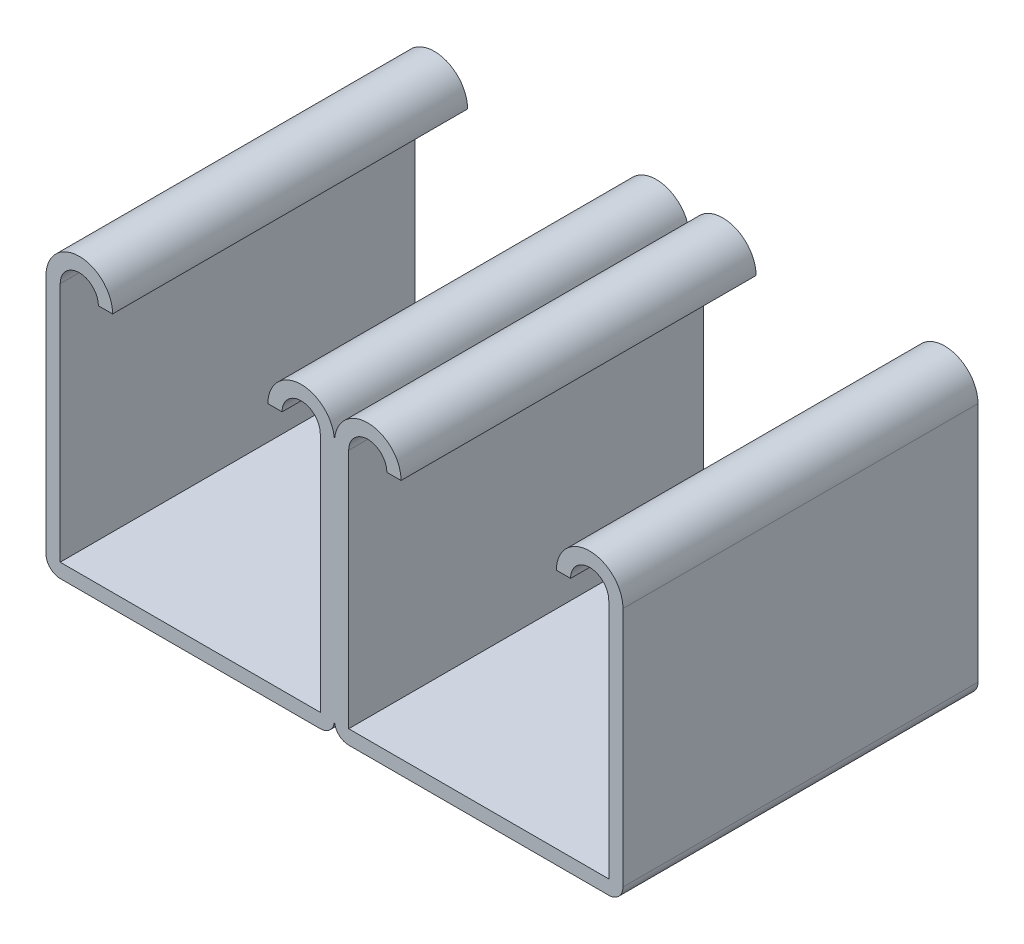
ISO-10303-21;
HEADER;
FILE_DESCRIPTION(('STEP AP214'),'2;1');
FILE_NAME('part.step','',(''),(''),'','','');
FILE_SCHEMA(('AUTOMOTIVE_DESIGN { 1 0 10303 214 1 1 1 1 }'));
ENDSEC;
DATA;
#1=APPLICATION_CONTEXT('core data for automotive mechanical design processes');
#2=APPLICATION_PROTOCOL_DEFINITION('international standard','automotive_design',2000,#1);
#3=PRODUCT_CONTEXT('',#1,'mechanical');
#4=PRODUCT('Part','Part','',(#3));
#5=PRODUCT_RELATED_PRODUCT_CATEGORY('part','',(#4));
#6=PRODUCT_DEFINITION_FORMATION('','',#4);
#7=PRODUCT_DEFINITION_CONTEXT('part definition',#1,'design');
#8=PRODUCT_DEFINITION('design','',#6,#7);
#9=PRODUCT_DEFINITION_SHAPE('','',#8);
#10=(LENGTH_UNIT() NAMED_UNIT(*) SI_UNIT(.MILLI.,.METRE.));
#11=(NAMED_UNIT(*) PLANE_ANGLE_UNIT() SI_UNIT($,.RADIAN.));
#12=(NAMED_UNIT(*) SI_UNIT($,.STERADIAN.) SOLID_ANGLE_UNIT());
#13=UNCERTAINTY_MEASURE_WITH_UNIT(LENGTH_MEASURE(1.E-05),#10,'distance_accuracy_value','');
#14=(GEOMETRIC_REPRESENTATION_CONTEXT(3) GLOBAL_UNCERTAINTY_ASSIGNED_CONTEXT((#13)) GLOBAL_UNIT_ASSIGNED_CONTEXT((#10,
#11,#12)) REPRESENTATION_CONTEXT('',''));
#15=CARTESIAN_POINT('',(0.,0.,0.));
#16=DIRECTION('',(0.,0.,1.));
#17=DIRECTION('',(1.,0.,0.));
#18=AXIS2_PLACEMENT_3D('',#15,#16,#17);
#19=CARTESIAN_POINT('',(-18.25625,9.37895,12.7));
#20=DIRECTION('',(0.,0.,-1.));
#21=DIRECTION('',(-1.,0.,0.));
#22=AXIS2_PLACEMENT_3D('',#19,#20,#21);
#23=CYLINDRICAL_SURFACE('',#22,2.38125);
#24=CARTESIAN_POINT('',(-18.25625,9.37895,-12.7));
#25=DIRECTION('',(0.,0.,1.));
#26=DIRECTION('',(-1.,0.,0.));
#27=AXIS2_PLACEMENT_3D('',#24,#25,#26);
#28=CIRCLE('',#27,2.38125);
#29=CARTESIAN_POINT('',(-15.875,9.37895,-12.7));
#30=VERTEX_POINT('',#29);
#31=CARTESIAN_POINT('',(-20.6375,9.37895,-12.7));
#32=VERTEX_POINT('',#31);
#33=EDGE_CURVE('E166',#30,#32,#28,.T.);
#34=ORIENTED_EDGE('',*,*,#33,.T.);
#35=DIRECTION('',(0.,0.,-1.));
#36=VECTOR('',#35,1.);
#37=CARTESIAN_POINT('',(-20.6375,9.37895,12.7));
#38=LINE('',#37,#36);
#39=CARTESIAN_POINT('',(-20.6375,9.37895,12.7));
#40=VERTEX_POINT('',#39);
#41=EDGE_CURVE('E11',#40,#32,#38,.T.);
#42=ORIENTED_EDGE('',*,*,#41,.F.);
#43=CARTESIAN_POINT('',(-18.25625,9.37895,12.7));
#44=DIRECTION('',(0.,0.,1.));
#45=DIRECTION('',(-1.,0.,0.));
#46=AXIS2_PLACEMENT_3D('',#43,#44,#45);
#47=CIRCLE('',#46,2.38125);
#48=CARTESIAN_POINT('',(-15.875,9.37895,12.7));
#49=VERTEX_POINT('',#48);
#50=EDGE_CURVE('E191',#49,#40,#47,.T.);
#51=ORIENTED_EDGE('',*,*,#50,.F.);
#52=DIRECTION('',(0.,0.,-1.));
#53=VECTOR('',#52,1.);
#54=CARTESIAN_POINT('',(-15.875,9.37895,12.7));
#55=LINE('',#54,#53);
#56=EDGE_CURVE('E162',#49,#30,#55,.T.);
#57=ORIENTED_EDGE('',*,*,#56,.T.);
#58=EDGE_LOOP('',(#34,#42,#51,#57));
#59=FACE_BOUND('',#58,.T.);
#60=ADVANCED_FACE('F33',(#59),#23,.T.);
#61=CARTESIAN_POINT('',(-20.6375,9.37895,12.7));
#62=DIRECTION('',(1.,0.,0.));
#63=DIRECTION('',(0.,1.,0.));
#64=AXIS2_PLACEMENT_3D('',#61,#62,#63);
#65=PLANE('',#64);
#66=DIRECTION('',(0.,-1.,0.));
#67=VECTOR('',#66,1.);
#68=CARTESIAN_POINT('',(-20.6375,9.37895,-12.7));
#69=LINE('',#68,#67);
#70=CARTESIAN_POINT('',(-20.6375,-7.874,-12.7));
#71=VERTEX_POINT('',#70);
#72=EDGE_CURVE('E169',#32,#71,#69,.T.);
#73=ORIENTED_EDGE('',*,*,#72,.T.);
#74=DIRECTION('',(0.,0.,-1.));
#75=VECTOR('',#74,1.);
#76=CARTESIAN_POINT('',(-20.6375,-7.874,12.7));
#77=LINE('',#76,#75);
#78=CARTESIAN_POINT('',(-20.6375,-7.874,12.7));
#79=VERTEX_POINT('',#78);
#80=EDGE_CURVE('E41',#79,#71,#77,.T.);
#81=ORIENTED_EDGE('',*,*,#80,.F.);
#82=DIRECTION('',(0.,-1.,0.));
#83=VECTOR('',#82,1.);
#84=CARTESIAN_POINT('',(-20.6375,9.37895,12.7));
#85=LINE('',#84,#83);
#86=EDGE_CURVE('E108',#40,#79,#85,.T.);
#87=ORIENTED_EDGE('',*,*,#86,.F.);
#88=ORIENTED_EDGE('',*,*,#41,.T.);
#89=EDGE_LOOP('',(#73,#81,#87,#88));
#90=FACE_BOUND('',#89,.T.);
#91=ADVANCED_FACE('F278',(#90),#65,.F.);
#92=CARTESIAN_POINT('',(-19.6215,-7.874,12.7));
#93=DIRECTION('',(0.,0.,-1.));
#94=DIRECTION('',(-1.,0.,0.));
#95=AXIS2_PLACEMENT_3D('',#92,#93,#94);
#96=CYLINDRICAL_SURFACE('',#95,1.016);
#97=CARTESIAN_POINT('',(-19.6215,-7.874,-12.7));
#98=DIRECTION('',(0.,0.,1.));
#99=DIRECTION('',(-1.,0.,0.));
#100=AXIS2_PLACEMENT_3D('',#97,#98,#99);
#101=CIRCLE('',#100,1.016);
#102=CARTESIAN_POINT('',(-19.6215,-8.89,-12.7));
#103=VERTEX_POINT('',#102);
#104=EDGE_CURVE('E172',#71,#103,#101,.T.);
#105=ORIENTED_EDGE('',*,*,#104,.T.);
#106=DIRECTION('',(0.,0.,-1.));
#107=VECTOR('',#106,1.);
#108=CARTESIAN_POINT('',(-19.6215,-8.89,12.7));
#109=LINE('',#108,#107);
#110=CARTESIAN_POINT('',(-19.6215,-8.89,12.7));
#111=VERTEX_POINT('',#110);
#112=EDGE_CURVE('E216',#111,#103,#109,.T.);
#113=ORIENTED_EDGE('',*,*,#112,.F.);
#114=CARTESIAN_POINT('',(-19.6215,-7.874,12.7));
#115=DIRECTION('',(0.,0.,1.));
#116=DIRECTION('',(-1.,0.,0.));
#117=AXIS2_PLACEMENT_3D('',#114,#115,#116);
#118=CIRCLE('',#117,1.016);
#119=EDGE_CURVE('E224',#79,#111,#118,.T.);
#120=ORIENTED_EDGE('',*,*,#119,.F.);
#121=ORIENTED_EDGE('',*,*,#80,.T.);
#122=EDGE_LOOP('',(#105,#113,#120,#121));
#123=FACE_BOUND('',#122,.T.);
#124=ADVANCED_FACE('F222',(#123),#96,.T.);
#125=CARTESIAN_POINT('',(-19.6215,-8.89,12.7));
#126=DIRECTION('',(0.,1.,0.));
#127=DIRECTION('',(-1.,0.,0.));
#128=AXIS2_PLACEMENT_3D('',#125,#126,#127);
#129=PLANE('',#128);
#130=DIRECTION('',(1.,0.,0.));
#131=VECTOR('',#130,1.);
#132=CARTESIAN_POINT('',(-19.6215,-8.89,-12.7));
#133=LINE('',#132,#131);
#134=CARTESIAN_POINT('',(-1.016,-8.89,-12.7));
#135=VERTEX_POINT('',#134);
#136=EDGE_CURVE('E174',#103,#135,#133,.T.);
#137=ORIENTED_EDGE('',*,*,#136,.T.);
#138=DIRECTION('',(0.,0.,-1.));
#139=VECTOR('',#138,1.);
#140=CARTESIAN_POINT('',(-1.016,-8.89,12.7));
#141=LINE('',#140,#139);
#142=CARTESIAN_POINT('',(-1.016,-8.89,12.7));
#143=VERTEX_POINT('',#142);
#144=EDGE_CURVE('E213',#143,#135,#141,.T.);
#145=ORIENTED_EDGE('',*,*,#144,.F.);
#146=DIRECTION('',(1.,0.,0.));
#147=VECTOR('',#146,1.);
#148=CARTESIAN_POINT('',(-19.6215,-8.89,12.7));
#149=LINE('',#148,#147);
#150=EDGE_CURVE('E243',#111,#143,#149,.T.);
#151=ORIENTED_EDGE('',*,*,#150,.F.);
#152=ORIENTED_EDGE('',*,*,#112,.T.);
#153=EDGE_LOOP('',(#137,#145,#151,#152));
#154=FACE_BOUND('',#153,.T.);
#155=ADVANCED_FACE('F233',(#154),#129,.F.);
#156=CARTESIAN_POINT('',(-1.016,-7.874,12.7));
#157=DIRECTION('',(0.,0.,-1.));
#158=DIRECTION('',(-1.,0.,0.));
#159=AXIS2_PLACEMENT_3D('',#156,#157,#158);
#160=CYLINDRICAL_SURFACE('',#159,1.016);
#161=CARTESIAN_POINT('',(-1.016,-7.874,-12.7));
#162=DIRECTION('',(0.,0.,1.));
#163=DIRECTION('',(1.,0.,0.));
#164=AXIS2_PLACEMENT_3D('',#161,#162,#163);
#165=CIRCLE('',#164,1.016);
#166=CARTESIAN_POINT('',(0.,-7.874,-12.7));
#167=VERTEX_POINT('',#166);
#168=EDGE_CURVE('E176',#135,#167,#165,.T.);
#169=ORIENTED_EDGE('',*,*,#168,.T.);
#170=DIRECTION('',(0.,0.,-1.));
#171=VECTOR('',#170,1.);
#172=CARTESIAN_POINT('',(0.,-7.874,12.7));
#173=LINE('',#172,#171);
#174=CARTESIAN_POINT('',(0.,-7.874,12.7));
#175=VERTEX_POINT('',#174);
#176=EDGE_CURVE('E210',#175,#167,#173,.T.);
#177=ORIENTED_EDGE('',*,*,#176,.F.);
#178=CARTESIAN_POINT('',(-1.016,-7.874,12.7));
#179=DIRECTION('',(0.,0.,1.));
#180=DIRECTION('',(1.,0.,0.));
#181=AXIS2_PLACEMENT_3D('',#178,#179,#180);
#182=CIRCLE('',#181,1.016);
#183=EDGE_CURVE('E239',#143,#175,#182,.T.);
#184=ORIENTED_EDGE('',*,*,#183,.F.);
#185=ORIENTED_EDGE('',*,*,#144,.T.);
#186=EDGE_LOOP('',(#169,#177,#184,#185));
#187=FACE_BOUND('',#186,.T.);
#188=ADVANCED_FACE('F237',(#187),#160,.T.);
#189=CARTESIAN_POINT('',(-2.38125,9.37895,12.7));
#190=DIRECTION('',(0.,0.,-1.));
#191=DIRECTION('',(-1.,0.,0.));
#192=AXIS2_PLACEMENT_3D('',#189,#190,#191);
#193=CYLINDRICAL_SURFACE('',#192,2.38125);
#194=CARTESIAN_POINT('',(-2.38125,9.37895,-12.7));
#195=DIRECTION('',(0.,0.,1.));
#196=DIRECTION('',(1.,0.,0.));
#197=AXIS2_PLACEMENT_3D('',#194,#195,#196);
#198=CIRCLE('',#197,2.38125);
#199=CARTESIAN_POINT('',(0.,9.37895,-12.7));
#200=VERTEX_POINT('',#199);
#201=CARTESIAN_POINT('',(-4.7625,9.37895,-12.7));
#202=VERTEX_POINT('',#201);
#203=EDGE_CURVE('E178',#200,#202,#198,.T.);
#204=ORIENTED_EDGE('',*,*,#203,.T.);
#205=DIRECTION('',(0.,0.,-1.));
#206=VECTOR('',#205,1.);
#207=CARTESIAN_POINT('',(-4.7625,9.37895,12.7));
#208=LINE('',#207,#206);
#209=CARTESIAN_POINT('',(-4.7625,9.37895,12.7));
#210=VERTEX_POINT('',#209);
#211=EDGE_CURVE('E204',#210,#202,#208,.T.);
#212=ORIENTED_EDGE('',*,*,#211,.F.);
#213=CARTESIAN_POINT('',(-2.38125,9.37895,12.7));
#214=DIRECTION('',(0.,0.,1.));
#215=DIRECTION('',(1.,0.,0.));
#216=AXIS2_PLACEMENT_3D('',#213,#214,#215);
#217=CIRCLE('',#216,2.38125);
#218=CARTESIAN_POINT('',(0.,9.37895,12.7));
#219=VERTEX_POINT('',#218);
#220=EDGE_CURVE('E242',#219,#210,#217,.T.);
#221=ORIENTED_EDGE('',*,*,#220,.F.);
#222=DIRECTION('',(0.,0.,-1.));
#223=VECTOR('',#222,1.);
#224=CARTESIAN_POINT('',(0.,9.37895,12.7));
#225=LINE('',#224,#223);
#226=EDGE_CURVE('E207',#219,#200,#225,.T.);
#227=ORIENTED_EDGE('',*,*,#226,.T.);
#228=EDGE_LOOP('',(#204,#212,#221,#227));
#229=FACE_BOUND('',#228,.T.);
#230=ADVANCED_FACE('F291',(#229),#193,.T.);
#231=CARTESIAN_POINT('',(-4.7625,9.37895,12.7));
#232=DIRECTION('',(0.,1.,0.));
#233=DIRECTION('',(0.,0.,1.));
#234=AXIS2_PLACEMENT_3D('',#231,#232,#233);
#235=PLANE('',#234);
#236=DIRECTION('',(1.,0.,0.));
#237=VECTOR('',#236,1.);
#238=CARTESIAN_POINT('',(-4.7625,9.37895,-12.7));
#239=LINE('',#238,#237);
#240=CARTESIAN_POINT('',(-3.7465,9.37895,-12.7));
#241=VERTEX_POINT('',#240);
#242=EDGE_CURVE('E180',#202,#241,#239,.T.);
#243=ORIENTED_EDGE('',*,*,#242,.T.);
#244=DIRECTION('',(0.,0.,-1.));
#245=VECTOR('',#244,1.);
#246=CARTESIAN_POINT('',(-3.7465,9.37895,12.7));
#247=LINE('',#246,#245);
#248=CARTESIAN_POINT('',(-3.7465,9.37895,12.7));
#249=VERTEX_POINT('',#248);
#250=EDGE_CURVE('E201',#249,#241,#247,.T.);
#251=ORIENTED_EDGE('',*,*,#250,.F.);
#252=DIRECTION('',(1.,0.,0.));
#253=VECTOR('',#252,1.);
#254=CARTESIAN_POINT('',(-4.7625,9.37895,12.7));
#255=LINE('',#254,#253);
#256=EDGE_CURVE('E245',#210,#249,#255,.T.);
#257=ORIENTED_EDGE('',*,*,#256,.F.);
#258=ORIENTED_EDGE('',*,*,#211,.T.);
#259=EDGE_LOOP('',(#243,#251,#257,#258));
#260=FACE_BOUND('',#259,.T.);
#261=ADVANCED_FACE('F294',(#260),#235,.F.);
#262=CARTESIAN_POINT('',(-2.38125,9.37895,12.7));
#263=DIRECTION('',(0.,0.,-1.));
#264=DIRECTION('',(-1.,0.,0.));
#265=AXIS2_PLACEMENT_3D('',#262,#263,#264);
#266=CYLINDRICAL_SURFACE('',#265,1.36525);
#267=CARTESIAN_POINT('',(-2.38125,9.37895,-12.7));
#268=DIRECTION('',(0.,0.,-1.));
#269=DIRECTION('',(1.,0.,0.));
#270=AXIS2_PLACEMENT_3D('',#267,#268,#269);
#271=CIRCLE('',#270,1.36525);
#272=CARTESIAN_POINT('',(-1.016,9.37895,-12.7));
#273=VERTEX_POINT('',#272);
#274=EDGE_CURVE('E182',#241,#273,#271,.T.);
#275=ORIENTED_EDGE('',*,*,#274,.T.);
#276=DIRECTION('',(0.,0.,-1.));
#277=VECTOR('',#276,1.);
#278=CARTESIAN_POINT('',(-1.016,9.37895,12.7));
#279=LINE('',#278,#277);
#280=CARTESIAN_POINT('',(-1.016,9.37895,12.7));
#281=VERTEX_POINT('',#280);
#282=EDGE_CURVE('E198',#281,#273,#279,.T.);
#283=ORIENTED_EDGE('',*,*,#282,.F.);
#284=CARTESIAN_POINT('',(-2.38125,9.37895,12.7));
#285=DIRECTION('',(0.,0.,-1.));
#286=DIRECTION('',(1.,0.,0.));
#287=AXIS2_PLACEMENT_3D('',#284,#285,#286);
#288=CIRCLE('',#287,1.36525);
#289=EDGE_CURVE('E251',#249,#281,#288,.T.);
#290=ORIENTED_EDGE('',*,*,#289,.F.);
#291=ORIENTED_EDGE('',*,*,#250,.T.);
#292=EDGE_LOOP('',(#275,#283,#290,#291));
#293=FACE_BOUND('',#292,.T.);
#294=ADVANCED_FACE('F298',(#293),#266,.F.);
#295=CARTESIAN_POINT('',(-1.016,-7.874,12.7));
#296=DIRECTION('',(1.,0.,0.));
#297=DIRECTION('',(0.,0.,-1.));
#298=AXIS2_PLACEMENT_3D('',#295,#296,#297);
#299=PLANE('',#298);
#300=DIRECTION('',(0.,-1.,0.));
#301=VECTOR('',#300,1.);
#302=CARTESIAN_POINT('',(-1.016,-7.874,-12.7));
#303=LINE('',#302,#301);
#304=CARTESIAN_POINT('',(-1.016,-7.874,-12.7));
#305=VERTEX_POINT('',#304);
#306=EDGE_CURVE('E184',#273,#305,#303,.T.);
#307=ORIENTED_EDGE('',*,*,#306,.T.);
#308=DIRECTION('',(0.,0.,-1.));
#309=VECTOR('',#308,1.);
#310=CARTESIAN_POINT('',(-1.016,-7.874,12.7));
#311=LINE('',#310,#309);
#312=CARTESIAN_POINT('',(-1.016,-7.874,12.7));
#313=VERTEX_POINT('',#312);
#314=EDGE_CURVE('E195',#313,#305,#311,.T.);
#315=ORIENTED_EDGE('',*,*,#314,.F.);
#316=DIRECTION('',(0.,-1.,0.));
#317=VECTOR('',#316,1.);
#318=CARTESIAN_POINT('',(-1.016,-7.874,12.7));
#319=LINE('',#318,#317);
#320=EDGE_CURVE('E253',#281,#313,#319,.T.);
#321=ORIENTED_EDGE('',*,*,#320,.F.);
#322=ORIENTED_EDGE('',*,*,#282,.T.);
#323=EDGE_LOOP('',(#307,#315,#321,#322));
#324=FACE_BOUND('',#323,.T.);
#325=ADVANCED_FACE('F259',(#324),#299,.F.);
#326=CARTESIAN_POINT('',(-19.6215,-7.874,12.7));
#327=DIRECTION('',(0.,-1.,0.));
#328=DIRECTION('',(0.,0.,-1.));
#329=AXIS2_PLACEMENT_3D('',#326,#327,#328);
#330=PLANE('',#329);
#331=DIRECTION('',(-1.,0.,0.));
#332=VECTOR('',#331,1.);
#333=CARTESIAN_POINT('',(-19.6215,-7.874,-12.7));
#334=LINE('',#333,#332);
#335=CARTESIAN_POINT('',(-19.6215,-7.874,-12.7));
#336=VERTEX_POINT('',#335);
#337=EDGE_CURVE('E186',#305,#336,#334,.T.);
#338=ORIENTED_EDGE('',*,*,#337,.T.);
#339=DIRECTION('',(0.,0.,-1.));
#340=VECTOR('',#339,1.);
#341=CARTESIAN_POINT('',(-19.6215,-7.874,12.7));
#342=LINE('',#341,#340);
#343=CARTESIAN_POINT('',(-19.6215,-7.874,12.7));
#344=VERTEX_POINT('',#343);
#345=EDGE_CURVE('E157',#344,#336,#342,.T.);
#346=ORIENTED_EDGE('',*,*,#345,.F.);
#347=DIRECTION('',(-1.,0.,0.));
#348=VECTOR('',#347,1.);
#349=CARTESIAN_POINT('',(-19.6215,-7.874,12.7));
#350=LINE('',#349,#348);
#351=EDGE_CURVE('E148',#313,#344,#350,.T.);
#352=ORIENTED_EDGE('',*,*,#351,.F.);
#353=ORIENTED_EDGE('',*,*,#314,.T.);
#354=EDGE_LOOP('',(#338,#346,#352,#353));
#355=FACE_BOUND('',#354,.T.);
#356=ADVANCED_FACE('F263',(#355),#330,.F.);
#357=CARTESIAN_POINT('',(-19.6215,9.37895,12.7));
#358=DIRECTION('',(-1.,0.,0.));
#359=DIRECTION('',(0.,0.,1.));
#360=AXIS2_PLACEMENT_3D('',#357,#358,#359);
#361=PLANE('',#360);
#362=DIRECTION('',(0.,1.,0.));
#363=VECTOR('',#362,1.);
#364=CARTESIAN_POINT('',(-19.6215,9.37895,-12.7));
#365=LINE('',#364,#363);
#366=CARTESIAN_POINT('',(-19.6215,9.37895,-12.7));
#367=VERTEX_POINT('',#366);
#368=EDGE_CURVE('E156',#336,#367,#365,.T.);
#369=ORIENTED_EDGE('',*,*,#368,.T.);
#370=DIRECTION('',(0.,0.,-1.));
#371=VECTOR('',#370,1.);
#372=CARTESIAN_POINT('',(-19.6215,9.37895,12.7));
#373=LINE('',#372,#371);
#374=CARTESIAN_POINT('',(-19.6215,9.37895,12.7));
#375=VERTEX_POINT('',#374);
#376=EDGE_CURVE('E153',#375,#367,#373,.T.);
#377=ORIENTED_EDGE('',*,*,#376,.F.);
#378=DIRECTION('',(0.,1.,0.));
#379=VECTOR('',#378,1.);
#380=CARTESIAN_POINT('',(-19.6215,9.37895,12.7));
#381=LINE('',#380,#379);
#382=EDGE_CURVE('E142',#344,#375,#381,.T.);
#383=ORIENTED_EDGE('',*,*,#382,.F.);
#384=ORIENTED_EDGE('',*,*,#345,.T.);
#385=EDGE_LOOP('',(#369,#377,#383,#384));
#386=FACE_BOUND('',#385,.T.);
#387=ADVANCED_FACE('F154',(#386),#361,.F.);
#388=CARTESIAN_POINT('',(-18.25625,9.37895,12.7));
#389=DIRECTION('',(0.,0.,-1.));
#390=DIRECTION('',(-1.,0.,0.));
#391=AXIS2_PLACEMENT_3D('',#388,#389,#390);
#392=CYLINDRICAL_SURFACE('',#391,1.36525);
#393=CARTESIAN_POINT('',(-18.25625,9.37895,-12.7));
#394=DIRECTION('',(0.,0.,-1.));
#395=DIRECTION('',(-1.,0.,0.));
#396=AXIS2_PLACEMENT_3D('',#393,#394,#395);
#397=CIRCLE('',#396,1.36525);
#398=CARTESIAN_POINT('',(-16.891,9.37895,-12.7));
#399=VERTEX_POINT('',#398);
#400=EDGE_CURVE('E94',#367,#399,#397,.T.);
#401=ORIENTED_EDGE('',*,*,#400,.T.);
#402=DIRECTION('',(0.,0.,-1.));
#403=VECTOR('',#402,1.);
#404=CARTESIAN_POINT('',(-16.891,9.37895,12.7));
#405=LINE('',#404,#403);
#406=CARTESIAN_POINT('',(-16.891,9.37895,12.7));
#407=VERTEX_POINT('',#406);
#408=EDGE_CURVE('E158',#407,#399,#405,.T.);
#409=ORIENTED_EDGE('',*,*,#408,.F.);
#410=CARTESIAN_POINT('',(-18.25625,9.37895,12.7));
#411=DIRECTION('',(0.,0.,-1.));
#412=DIRECTION('',(-1.,0.,0.));
#413=AXIS2_PLACEMENT_3D('',#410,#411,#412);
#414=CIRCLE('',#413,1.36525);
#415=EDGE_CURVE('E146',#375,#407,#414,.T.);
#416=ORIENTED_EDGE('',*,*,#415,.F.);
#417=ORIENTED_EDGE('',*,*,#376,.T.);
#418=EDGE_LOOP('',(#401,#409,#416,#417));
#419=FACE_BOUND('',#418,.T.);
#420=ADVANCED_FACE('F160',(#419),#392,.F.);
#421=CARTESIAN_POINT('',(-16.891,9.37895,12.7));
#422=DIRECTION('',(0.,1.,0.));
#423=DIRECTION('',(0.,0.,1.));
#424=AXIS2_PLACEMENT_3D('',#421,#422,#423);
#425=PLANE('',#424);
#426=DIRECTION('',(1.,0.,0.));
#427=VECTOR('',#426,1.);
#428=CARTESIAN_POINT('',(-16.891,9.37895,-12.7));
#429=LINE('',#428,#427);
#430=EDGE_CURVE('E100',#399,#30,#429,.T.);
#431=ORIENTED_EDGE('',*,*,#430,.T.);
#432=ORIENTED_EDGE('',*,*,#56,.F.);
#433=DIRECTION('',(1.,0.,0.));
#434=VECTOR('',#433,1.);
#435=CARTESIAN_POINT('',(-16.891,9.37895,12.7));
#436=LINE('',#435,#434);
#437=EDGE_CURVE('E49',#407,#49,#436,.T.);
#438=ORIENTED_EDGE('',*,*,#437,.F.);
#439=ORIENTED_EDGE('',*,*,#408,.T.);
#440=EDGE_LOOP('',(#431,#432,#438,#439));
#441=FACE_BOUND('',#440,.T.);
#442=ADVANCED_FACE('F267',(#441),#425,.F.);
#443=CARTESIAN_POINT('',(-18.25625,9.37895,12.7));
#444=DIRECTION('',(0.,0.,-1.));
#445=DIRECTION('',(-1.,0.,0.));
#446=AXIS2_PLACEMENT_3D('',#443,#444,#445);
#447=PLANE('',#446);
#448=ORIENTED_EDGE('',*,*,#50,.T.);
#449=ORIENTED_EDGE('',*,*,#86,.T.);
#450=ORIENTED_EDGE('',*,*,#119,.T.);
#451=ORIENTED_EDGE('',*,*,#150,.T.);
#452=ORIENTED_EDGE('',*,*,#183,.T.);
#453=CARTESIAN_POINT('',(1.016,-7.874,12.7));
#454=DIRECTION('',(0.,0.,1.));
#455=DIRECTION('',(-1.,0.,0.));
#456=AXIS2_PLACEMENT_3D('',#453,#454,#455);
#457=CIRCLE('',#456,1.016);
#458=CARTESIAN_POINT('',(1.016,-8.89,12.7));
#459=VERTEX_POINT('',#458);
#460=EDGE_CURVE('E670',#175,#459,#457,.T.);
#461=ORIENTED_EDGE('',*,*,#460,.T.);
#462=DIRECTION('',(1.,0.,0.));
#463=VECTOR('',#462,1.);
#464=CARTESIAN_POINT('',(1.016,-8.89,12.7));
#465=LINE('',#464,#463);
#466=CARTESIAN_POINT('',(19.6215,-8.89,12.7));
#467=VERTEX_POINT('',#466);
#468=EDGE_CURVE('E584',#459,#467,#465,.T.);
#469=ORIENTED_EDGE('',*,*,#468,.T.);
#470=CARTESIAN_POINT('',(19.6215,-7.874,12.7));
#471=DIRECTION('',(0.,0.,1.));
#472=DIRECTION('',(1.,0.,0.));
#473=AXIS2_PLACEMENT_3D('',#470,#471,#472);
#474=CIRCLE('',#473,1.016);
#475=CARTESIAN_POINT('',(20.6375,-7.874,12.7));
#476=VERTEX_POINT('',#475);
#477=EDGE_CURVE('E607',#467,#476,#474,.T.);
#478=ORIENTED_EDGE('',*,*,#477,.T.);
#479=DIRECTION('',(0.,1.,0.));
#480=VECTOR('',#479,1.);
#481=CARTESIAN_POINT('',(20.6375,-7.874,12.7));
#482=LINE('',#481,#480);
#483=CARTESIAN_POINT('',(20.6375,9.37895,12.7));
#484=VERTEX_POINT('',#483);
#485=EDGE_CURVE('E599',#476,#484,#482,.T.);
#486=ORIENTED_EDGE('',*,*,#485,.T.);
#487=CARTESIAN_POINT('',(18.25625,9.37895,12.7));
#488=DIRECTION('',(0.,0.,1.));
#489=DIRECTION('',(1.,0.,0.));
#490=AXIS2_PLACEMENT_3D('',#487,#488,#489);
#491=CIRCLE('',#490,2.38125);
#492=CARTESIAN_POINT('',(15.875,9.37895,12.7));
#493=VERTEX_POINT('',#492);
#494=EDGE_CURVE('E606',#484,#493,#491,.T.);
#495=ORIENTED_EDGE('',*,*,#494,.T.);
#496=DIRECTION('',(1.,0.,0.));
#497=VECTOR('',#496,1.);
#498=CARTESIAN_POINT('',(15.875,9.37895,12.7));
#499=LINE('',#498,#497);
#500=CARTESIAN_POINT('',(16.891,9.37895,12.7));
#501=VERTEX_POINT('',#500);
#502=EDGE_CURVE('E609',#493,#501,#499,.T.);
#503=ORIENTED_EDGE('',*,*,#502,.T.);
#504=CARTESIAN_POINT('',(18.25625,9.37895,12.7));
#505=DIRECTION('',(0.,0.,-1.));
#506=DIRECTION('',(1.,0.,0.));
#507=AXIS2_PLACEMENT_3D('',#504,#505,#506);
#508=CIRCLE('',#507,1.36525);
#509=CARTESIAN_POINT('',(19.6215,9.37895,12.7));
#510=VERTEX_POINT('',#509);
#511=EDGE_CURVE('E616',#501,#510,#508,.T.);
#512=ORIENTED_EDGE('',*,*,#511,.T.);
#513=DIRECTION('',(0.,-1.,0.));
#514=VECTOR('',#513,1.);
#515=CARTESIAN_POINT('',(19.6215,-7.874,12.7));
#516=LINE('',#515,#514);
#517=CARTESIAN_POINT('',(19.6215,-7.874,12.7));
#518=VERTEX_POINT('',#517);
#519=EDGE_CURVE('E619',#510,#518,#516,.T.);
#520=ORIENTED_EDGE('',*,*,#519,.T.);
#521=DIRECTION('',(-1.,0.,0.));
#522=VECTOR('',#521,1.);
#523=CARTESIAN_POINT('',(1.016,-7.874,12.7));
#524=LINE('',#523,#522);
#525=CARTESIAN_POINT('',(1.016,-7.874,12.7));
#526=VERTEX_POINT('',#525);
#527=EDGE_CURVE('E622',#518,#526,#524,.T.);
#528=ORIENTED_EDGE('',*,*,#527,.T.);
#529=DIRECTION('',(0.,1.,0.));
#530=VECTOR('',#529,1.);
#531=CARTESIAN_POINT('',(1.016,9.37895,12.7));
#532=LINE('',#531,#530);
#533=CARTESIAN_POINT('',(1.016,9.37895,12.7));
#534=VERTEX_POINT('',#533);
#535=EDGE_CURVE('E625',#526,#534,#532,.T.);
#536=ORIENTED_EDGE('',*,*,#535,.T.);
#537=CARTESIAN_POINT('',(2.38125,9.37895,12.7));
#538=DIRECTION('',(0.,0.,-1.));
#539=DIRECTION('',(-1.,0.,0.));
#540=AXIS2_PLACEMENT_3D('',#537,#538,#539);
#541=CIRCLE('',#540,1.36525);
#542=CARTESIAN_POINT('',(3.7465,9.37895,12.7));
#543=VERTEX_POINT('',#542);
#544=EDGE_CURVE('E627',#534,#543,#541,.T.);
#545=ORIENTED_EDGE('',*,*,#544,.T.);
#546=DIRECTION('',(1.,0.,0.));
#547=VECTOR('',#546,1.);
#548=CARTESIAN_POINT('',(3.7465,9.37895,12.7));
#549=LINE('',#548,#547);
#550=CARTESIAN_POINT('',(4.7625,9.37895,12.7));
#551=VERTEX_POINT('',#550);
#552=EDGE_CURVE('E506',#543,#551,#549,.T.);
#553=ORIENTED_EDGE('',*,*,#552,.T.);
#554=CARTESIAN_POINT('',(2.38125,9.37895,12.7));
#555=DIRECTION('',(0.,0.,1.));
#556=DIRECTION('',(-1.,0.,0.));
#557=AXIS2_PLACEMENT_3D('',#554,#555,#556);
#558=CIRCLE('',#557,2.38125);
#559=EDGE_CURVE('E498',#551,#219,#558,.T.);
#560=ORIENTED_EDGE('',*,*,#559,.T.);
#561=ORIENTED_EDGE('',*,*,#220,.T.);
#562=ORIENTED_EDGE('',*,*,#256,.T.);
#563=ORIENTED_EDGE('',*,*,#289,.T.);
#564=ORIENTED_EDGE('',*,*,#320,.T.);
#565=ORIENTED_EDGE('',*,*,#351,.T.);
#566=ORIENTED_EDGE('',*,*,#382,.T.);
#567=ORIENTED_EDGE('',*,*,#415,.T.);
#568=ORIENTED_EDGE('',*,*,#437,.T.);
#569=EDGE_LOOP('',(#448,#449,#450,#451,#452,#461,#469,#478,#486,#495,#503,#512,#520,#528,#536,
#545,#553,#560,#561,#562,#563,#564,#565,#566,#567,#568));
#570=FACE_BOUND('',#569,.T.);
#571=ADVANCED_FACE('F144',(#570),#447,.F.);
#572=CARTESIAN_POINT('',(-18.25625,9.37895,-12.7));
#573=DIRECTION('',(0.,0.,-1.));
#574=DIRECTION('',(-1.,0.,0.));
#575=AXIS2_PLACEMENT_3D('',#572,#573,#574);
#576=PLANE('',#575);
#577=ORIENTED_EDGE('',*,*,#33,.F.);
#578=ORIENTED_EDGE('',*,*,#430,.F.);
#579=ORIENTED_EDGE('',*,*,#400,.F.);
#580=ORIENTED_EDGE('',*,*,#368,.F.);
#581=ORIENTED_EDGE('',*,*,#337,.F.);
#582=ORIENTED_EDGE('',*,*,#306,.F.);
#583=ORIENTED_EDGE('',*,*,#274,.F.);
#584=ORIENTED_EDGE('',*,*,#242,.F.);
#585=ORIENTED_EDGE('',*,*,#203,.F.);
#586=CARTESIAN_POINT('',(2.38125,9.37895,-12.7));
#587=DIRECTION('',(0.,0.,1.));
#588=DIRECTION('',(-1.,0.,0.));
#589=AXIS2_PLACEMENT_3D('',#586,#587,#588);
#590=CIRCLE('',#589,2.38125);
#591=CARTESIAN_POINT('',(4.7625,9.37895,-12.7));
#592=VERTEX_POINT('',#591);
#593=EDGE_CURVE('E504',#592,#200,#590,.T.);
#594=ORIENTED_EDGE('',*,*,#593,.F.);
#595=DIRECTION('',(1.,0.,0.));
#596=VECTOR('',#595,1.);
#597=CARTESIAN_POINT('',(3.7465,9.37895,-12.7));
#598=LINE('',#597,#596);
#599=CARTESIAN_POINT('',(3.7465,9.37895,-12.7));
#600=VERTEX_POINT('',#599);
#601=EDGE_CURVE('E487',#600,#592,#598,.T.);
#602=ORIENTED_EDGE('',*,*,#601,.F.);
#603=CARTESIAN_POINT('',(2.38125,9.37895,-12.7));
#604=DIRECTION('',(0.,0.,-1.));
#605=DIRECTION('',(-1.,0.,0.));
#606=AXIS2_PLACEMENT_3D('',#603,#604,#605);
#607=CIRCLE('',#606,1.36525);
#608=CARTESIAN_POINT('',(1.016,9.37895,-12.7));
#609=VERTEX_POINT('',#608);
#610=EDGE_CURVE('E499',#609,#600,#607,.T.);
#611=ORIENTED_EDGE('',*,*,#610,.F.);
#612=DIRECTION('',(0.,1.,0.));
#613=VECTOR('',#612,1.);
#614=CARTESIAN_POINT('',(1.016,9.37895,-12.7));
#615=LINE('',#614,#613);
#616=CARTESIAN_POINT('',(1.016,-7.874,-12.7));
#617=VERTEX_POINT('',#616);
#618=EDGE_CURVE('E541',#617,#609,#615,.T.);
#619=ORIENTED_EDGE('',*,*,#618,.F.);
#620=DIRECTION('',(-1.,0.,0.));
#621=VECTOR('',#620,1.);
#622=CARTESIAN_POINT('',(1.016,-7.874,-12.7));
#623=LINE('',#622,#621);
#624=CARTESIAN_POINT('',(19.6215,-7.874,-12.7));
#625=VERTEX_POINT('',#624);
#626=EDGE_CURVE('E538',#625,#617,#623,.T.);
#627=ORIENTED_EDGE('',*,*,#626,.F.);
#628=DIRECTION('',(0.,-1.,0.));
#629=VECTOR('',#628,1.);
#630=CARTESIAN_POINT('',(19.6215,-7.874,-12.7));
#631=LINE('',#630,#629);
#632=CARTESIAN_POINT('',(19.6215,9.37895,-12.7));
#633=VERTEX_POINT('',#632);
#634=EDGE_CURVE('E535',#633,#625,#631,.T.);
#635=ORIENTED_EDGE('',*,*,#634,.F.);
#636=CARTESIAN_POINT('',(18.25625,9.37895,-12.7));
#637=DIRECTION('',(0.,0.,-1.));
#638=DIRECTION('',(1.,0.,0.));
#639=AXIS2_PLACEMENT_3D('',#636,#637,#638);
#640=CIRCLE('',#639,1.36525);
#641=CARTESIAN_POINT('',(16.891,9.37895,-12.7));
#642=VERTEX_POINT('',#641);
#643=EDGE_CURVE('E532',#642,#633,#640,.T.);
#644=ORIENTED_EDGE('',*,*,#643,.F.);
#645=DIRECTION('',(1.,0.,0.));
#646=VECTOR('',#645,1.);
#647=CARTESIAN_POINT('',(15.875,9.37895,-12.7));
#648=LINE('',#647,#646);
#649=CARTESIAN_POINT('',(15.875,9.37895,-12.7));
#650=VERTEX_POINT('',#649);
#651=EDGE_CURVE('E529',#650,#642,#648,.T.);
#652=ORIENTED_EDGE('',*,*,#651,.F.);
#653=CARTESIAN_POINT('',(18.25625,9.37895,-12.7));
#654=DIRECTION('',(0.,0.,1.));
#655=DIRECTION('',(1.,0.,0.));
#656=AXIS2_PLACEMENT_3D('',#653,#654,#655);
#657=CIRCLE('',#656,2.38125);
#658=CARTESIAN_POINT('',(20.6375,9.37895,-12.7));
#659=VERTEX_POINT('',#658);
#660=EDGE_CURVE('E526',#659,#650,#657,.T.);
#661=ORIENTED_EDGE('',*,*,#660,.F.);
#662=DIRECTION('',(0.,1.,0.));
#663=VECTOR('',#662,1.);
#664=CARTESIAN_POINT('',(20.6375,-7.874,-12.7));
#665=LINE('',#664,#663);
#666=CARTESIAN_POINT('',(20.6375,-7.874,-12.7));
#667=VERTEX_POINT('',#666);
#668=EDGE_CURVE('E523',#667,#659,#665,.T.);
#669=ORIENTED_EDGE('',*,*,#668,.F.);
#670=CARTESIAN_POINT('',(19.6215,-7.874,-12.7));
#671=DIRECTION('',(0.,0.,1.));
#672=DIRECTION('',(1.,0.,0.));
#673=AXIS2_PLACEMENT_3D('',#670,#671,#672);
#674=CIRCLE('',#673,1.016);
#675=CARTESIAN_POINT('',(19.6215,-8.89,-12.7));
#676=VERTEX_POINT('',#675);
#677=EDGE_CURVE('E520',#676,#667,#674,.T.);
#678=ORIENTED_EDGE('',*,*,#677,.F.);
#679=DIRECTION('',(1.,0.,0.));
#680=VECTOR('',#679,1.);
#681=CARTESIAN_POINT('',(1.016,-8.89,-12.7));
#682=LINE('',#681,#680);
#683=CARTESIAN_POINT('',(1.016,-8.89,-12.7));
#684=VERTEX_POINT('',#683);
#685=EDGE_CURVE('E513',#684,#676,#682,.T.);
#686=ORIENTED_EDGE('',*,*,#685,.F.);
#687=CARTESIAN_POINT('',(1.016,-7.874,-12.7));
#688=DIRECTION('',(0.,0.,1.));
#689=DIRECTION('',(-1.,0.,0.));
#690=AXIS2_PLACEMENT_3D('',#687,#688,#689);
#691=CIRCLE('',#690,1.016);
#692=EDGE_CURVE('E510',#167,#684,#691,.T.);
#693=ORIENTED_EDGE('',*,*,#692,.F.);
#694=ORIENTED_EDGE('',*,*,#168,.F.);
#695=ORIENTED_EDGE('',*,*,#136,.F.);
#696=ORIENTED_EDGE('',*,*,#104,.F.);
#697=ORIENTED_EDGE('',*,*,#72,.F.);
#698=EDGE_LOOP('',(#577,#578,#579,#580,#581,#582,#583,#584,#585,#594,#602,#611,#619,#627,#635,
#644,#652,#661,#669,#678,#686,#693,#694,#695,#696,#697));
#699=FACE_BOUND('',#698,.T.);
#700=ADVANCED_FACE('F228',(#699),#576,.T.);
#701=CARTESIAN_POINT('',(2.38125,9.37895,12.7));
#702=DIRECTION('',(0.,0.,-1.));
#703=DIRECTION('',(-1.,0.,0.));
#704=AXIS2_PLACEMENT_3D('',#701,#702,#703);
#705=CYLINDRICAL_SURFACE('',#704,2.38125);
#706=ORIENTED_EDGE('',*,*,#593,.T.);
#707=ORIENTED_EDGE('',*,*,#226,.F.);
#708=ORIENTED_EDGE('',*,*,#559,.F.);
#709=DIRECTION('',(0.,0.,-1.));
#710=VECTOR('',#709,1.);
#711=CARTESIAN_POINT('',(4.7625,9.37895,12.7));
#712=LINE('',#711,#710);
#713=EDGE_CURVE('E490',#551,#592,#712,.T.);
#714=ORIENTED_EDGE('',*,*,#713,.T.);
#715=EDGE_LOOP('',(#706,#707,#708,#714));
#716=FACE_BOUND('',#715,.T.);
#717=ADVANCED_FACE('F351',(#716),#705,.T.);
#718=CARTESIAN_POINT('',(1.016,-7.874,12.7));
#719=DIRECTION('',(0.,0.,-1.));
#720=DIRECTION('',(-1.,0.,0.));
#721=AXIS2_PLACEMENT_3D('',#718,#719,#720);
#722=CYLINDRICAL_SURFACE('',#721,1.016);
#723=ORIENTED_EDGE('',*,*,#692,.T.);
#724=DIRECTION('',(0.,0.,-1.));
#725=VECTOR('',#724,1.);
#726=CARTESIAN_POINT('',(1.016,-8.89,12.7));
#727=LINE('',#726,#725);
#728=EDGE_CURVE('E170',#459,#684,#727,.T.);
#729=ORIENTED_EDGE('',*,*,#728,.F.);
#730=ORIENTED_EDGE('',*,*,#460,.F.);
#731=ORIENTED_EDGE('',*,*,#176,.T.);
#732=EDGE_LOOP('',(#723,#729,#730,#731));
#733=FACE_BOUND('',#732,.T.);
#734=ADVANCED_FACE('F359',(#733),#722,.T.);
#735=CARTESIAN_POINT('',(1.016,-8.89,12.7));
#736=DIRECTION('',(0.,1.,0.));
#737=DIRECTION('',(-1.,0.,0.));
#738=AXIS2_PLACEMENT_3D('',#735,#736,#737);
#739=PLANE('',#738);
#740=ORIENTED_EDGE('',*,*,#685,.T.);
#741=DIRECTION('',(0.,0.,-1.));
#742=VECTOR('',#741,1.);
#743=CARTESIAN_POINT('',(19.6215,-8.89,12.7));
#744=LINE('',#743,#742);
#745=EDGE_CURVE('E571',#467,#676,#744,.T.);
#746=ORIENTED_EDGE('',*,*,#745,.F.);
#747=ORIENTED_EDGE('',*,*,#468,.F.);
#748=ORIENTED_EDGE('',*,*,#728,.T.);
#749=EDGE_LOOP('',(#740,#746,#747,#748));
#750=FACE_BOUND('',#749,.T.);
#751=ADVANCED_FACE('F369',(#750),#739,.F.);
#752=CARTESIAN_POINT('',(19.6215,-7.874,12.7));
#753=DIRECTION('',(0.,0.,-1.));
#754=DIRECTION('',(-1.,0.,0.));
#755=AXIS2_PLACEMENT_3D('',#752,#753,#754);
#756=CYLINDRICAL_SURFACE('',#755,1.016);
#757=ORIENTED_EDGE('',*,*,#677,.T.);
#758=DIRECTION('',(0.,0.,-1.));
#759=VECTOR('',#758,1.);
#760=CARTESIAN_POINT('',(20.6375,-7.874,12.7));
#761=LINE('',#760,#759);
#762=EDGE_CURVE('E568',#476,#667,#761,.T.);
#763=ORIENTED_EDGE('',*,*,#762,.F.);
#764=ORIENTED_EDGE('',*,*,#477,.F.);
#765=ORIENTED_EDGE('',*,*,#745,.T.);
#766=EDGE_LOOP('',(#757,#763,#764,#765));
#767=FACE_BOUND('',#766,.T.);
#768=ADVANCED_FACE('F379',(#767),#756,.T.);
#769=CARTESIAN_POINT('',(20.6375,-7.874,12.7));
#770=DIRECTION('',(-1.,0.,0.));
#771=DIRECTION('',(0.,0.,1.));
#772=AXIS2_PLACEMENT_3D('',#769,#770,#771);
#773=PLANE('',#772);
#774=ORIENTED_EDGE('',*,*,#668,.T.);
#775=DIRECTION('',(0.,0.,-1.));
#776=VECTOR('',#775,1.);
#777=CARTESIAN_POINT('',(20.6375,9.37895,12.7));
#778=LINE('',#777,#776);
#779=EDGE_CURVE('E565',#484,#659,#778,.T.);
#780=ORIENTED_EDGE('',*,*,#779,.F.);
#781=ORIENTED_EDGE('',*,*,#485,.F.);
#782=ORIENTED_EDGE('',*,*,#762,.T.);
#783=EDGE_LOOP('',(#774,#780,#781,#782));
#784=FACE_BOUND('',#783,.T.);
#785=ADVANCED_FACE('F389',(#784),#773,.F.);
#786=CARTESIAN_POINT('',(18.25625,9.37895,12.7));
#787=DIRECTION('',(0.,0.,-1.));
#788=DIRECTION('',(-1.,0.,0.));
#789=AXIS2_PLACEMENT_3D('',#786,#787,#788);
#790=CYLINDRICAL_SURFACE('',#789,2.38125);
#791=ORIENTED_EDGE('',*,*,#660,.T.);
#792=DIRECTION('',(0.,0.,-1.));
#793=VECTOR('',#792,1.);
#794=CARTESIAN_POINT('',(15.875,9.37895,12.7));
#795=LINE('',#794,#793);
#796=EDGE_CURVE('E562',#493,#650,#795,.T.);
#797=ORIENTED_EDGE('',*,*,#796,.F.);
#798=ORIENTED_EDGE('',*,*,#494,.F.);
#799=ORIENTED_EDGE('',*,*,#779,.T.);
#800=EDGE_LOOP('',(#791,#797,#798,#799));
#801=FACE_BOUND('',#800,.T.);
#802=ADVANCED_FACE('F399',(#801),#790,.T.);
#803=CARTESIAN_POINT('',(15.875,9.37895,12.7));
#804=DIRECTION('',(0.,1.,0.));
#805=DIRECTION('',(0.,0.,1.));
#806=AXIS2_PLACEMENT_3D('',#803,#804,#805);
#807=PLANE('',#806);
#808=ORIENTED_EDGE('',*,*,#651,.T.);
#809=DIRECTION('',(0.,0.,-1.));
#810=VECTOR('',#809,1.);
#811=CARTESIAN_POINT('',(16.891,9.37895,12.7));
#812=LINE('',#811,#810);
#813=EDGE_CURVE('E559',#501,#642,#812,.T.);
#814=ORIENTED_EDGE('',*,*,#813,.F.);
#815=ORIENTED_EDGE('',*,*,#502,.F.);
#816=ORIENTED_EDGE('',*,*,#796,.T.);
#817=EDGE_LOOP('',(#808,#814,#815,#816));
#818=FACE_BOUND('',#817,.T.);
#819=ADVANCED_FACE('F409',(#818),#807,.F.);
#820=CARTESIAN_POINT('',(18.25625,9.37895,12.7));
#821=DIRECTION('',(0.,0.,-1.));
#822=DIRECTION('',(-1.,0.,0.));
#823=AXIS2_PLACEMENT_3D('',#820,#821,#822);
#824=CYLINDRICAL_SURFACE('',#823,1.36525);
#825=ORIENTED_EDGE('',*,*,#643,.T.);
#826=DIRECTION('',(0.,0.,-1.));
#827=VECTOR('',#826,1.);
#828=CARTESIAN_POINT('',(19.6215,9.37895,12.7));
#829=LINE('',#828,#827);
#830=EDGE_CURVE('E556',#510,#633,#829,.T.);
#831=ORIENTED_EDGE('',*,*,#830,.F.);
#832=ORIENTED_EDGE('',*,*,#511,.F.);
#833=ORIENTED_EDGE('',*,*,#813,.T.);
#834=EDGE_LOOP('',(#825,#831,#832,#833));
#835=FACE_BOUND('',#834,.T.);
#836=ADVANCED_FACE('F419',(#835),#824,.F.);
#837=CARTESIAN_POINT('',(19.6215,-7.874,12.7));
#838=DIRECTION('',(1.,0.,0.));
#839=DIRECTION('',(0.,0.,-1.));
#840=AXIS2_PLACEMENT_3D('',#837,#838,#839);
#841=PLANE('',#840);
#842=ORIENTED_EDGE('',*,*,#634,.T.);
#843=DIRECTION('',(0.,0.,-1.));
#844=VECTOR('',#843,1.);
#845=CARTESIAN_POINT('',(19.6215,-7.874,12.7));
#846=LINE('',#845,#844);
#847=EDGE_CURVE('E553',#518,#625,#846,.T.);
#848=ORIENTED_EDGE('',*,*,#847,.F.);
#849=ORIENTED_EDGE('',*,*,#519,.F.);
#850=ORIENTED_EDGE('',*,*,#830,.T.);
#851=EDGE_LOOP('',(#842,#848,#849,#850));
#852=FACE_BOUND('',#851,.T.);
#853=ADVANCED_FACE('F429',(#852),#841,.F.);
#854=CARTESIAN_POINT('',(1.016,-7.874,12.7));
#855=DIRECTION('',(0.,-1.,0.));
#856=DIRECTION('',(0.,0.,-1.));
#857=AXIS2_PLACEMENT_3D('',#854,#855,#856);
#858=PLANE('',#857);
#859=ORIENTED_EDGE('',*,*,#626,.T.);
#860=DIRECTION('',(0.,0.,-1.));
#861=VECTOR('',#860,1.);
#862=CARTESIAN_POINT('',(1.016,-7.874,12.7));
#863=LINE('',#862,#861);
#864=EDGE_CURVE('E550',#526,#617,#863,.T.);
#865=ORIENTED_EDGE('',*,*,#864,.F.);
#866=ORIENTED_EDGE('',*,*,#527,.F.);
#867=ORIENTED_EDGE('',*,*,#847,.T.);
#868=EDGE_LOOP('',(#859,#865,#866,#867));
#869=FACE_BOUND('',#868,.T.);
#870=ADVANCED_FACE('F439',(#869),#858,.F.);
#871=CARTESIAN_POINT('',(1.016,9.37895,12.7));
#872=DIRECTION('',(-1.,0.,0.));
#873=DIRECTION('',(0.,0.,1.));
#874=AXIS2_PLACEMENT_3D('',#871,#872,#873);
#875=PLANE('',#874);
#876=ORIENTED_EDGE('',*,*,#618,.T.);
#877=DIRECTION('',(0.,0.,-1.));
#878=VECTOR('',#877,1.);
#879=CARTESIAN_POINT('',(1.016,9.37895,12.7));
#880=LINE('',#879,#878);
#881=EDGE_CURVE('E547',#534,#609,#880,.T.);
#882=ORIENTED_EDGE('',*,*,#881,.F.);
#883=ORIENTED_EDGE('',*,*,#535,.F.);
#884=ORIENTED_EDGE('',*,*,#864,.T.);
#885=EDGE_LOOP('',(#876,#882,#883,#884));
#886=FACE_BOUND('',#885,.T.);
#887=ADVANCED_FACE('F449',(#886),#875,.F.);
#888=CARTESIAN_POINT('',(2.38125,9.37895,12.7));
#889=DIRECTION('',(0.,0.,-1.));
#890=DIRECTION('',(-1.,0.,0.));
#891=AXIS2_PLACEMENT_3D('',#888,#889,#890);
#892=CYLINDRICAL_SURFACE('',#891,1.36525);
#893=ORIENTED_EDGE('',*,*,#610,.T.);
#894=DIRECTION('',(0.,0.,-1.));
#895=VECTOR('',#894,1.);
#896=CARTESIAN_POINT('',(3.7465,9.37895,12.7));
#897=LINE('',#896,#895);
#898=EDGE_CURVE('E494',#543,#600,#897,.T.);
#899=ORIENTED_EDGE('',*,*,#898,.F.);
#900=ORIENTED_EDGE('',*,*,#544,.F.);
#901=ORIENTED_EDGE('',*,*,#881,.T.);
#902=EDGE_LOOP('',(#893,#899,#900,#901));
#903=FACE_BOUND('',#902,.T.);
#904=ADVANCED_FACE('F459',(#903),#892,.F.);
#905=CARTESIAN_POINT('',(3.7465,9.37895,12.7));
#906=DIRECTION('',(0.,1.,0.));
#907=DIRECTION('',(0.,0.,1.));
#908=AXIS2_PLACEMENT_3D('',#905,#906,#907);
#909=PLANE('',#908);
#910=ORIENTED_EDGE('',*,*,#601,.T.);
#911=ORIENTED_EDGE('',*,*,#713,.F.);
#912=ORIENTED_EDGE('',*,*,#552,.F.);
#913=ORIENTED_EDGE('',*,*,#898,.T.);
#914=EDGE_LOOP('',(#910,#911,#912,#913));
#915=FACE_BOUND('',#914,.T.);
#916=ADVANCED_FACE('F469',(#915),#909,.F.);
#917=CLOSED_SHELL('',(#60,#91,#124,#155,#188,#230,#261,#294,#325,#356,#387,#420,#442,#571,#700,
#717,#734,#751,#768,#785,#802,#819,#836,#853,#870,#887,#904,#916));
#918=MANIFOLD_SOLID_BREP('B2',#917);
#919=ADVANCED_BREP_SHAPE_REPRESENTATION('',(#18,#918),#14);
#920=SHAPE_DEFINITION_REPRESENTATION(#9,#919);
ENDSEC;
END-ISO-10303-21;
